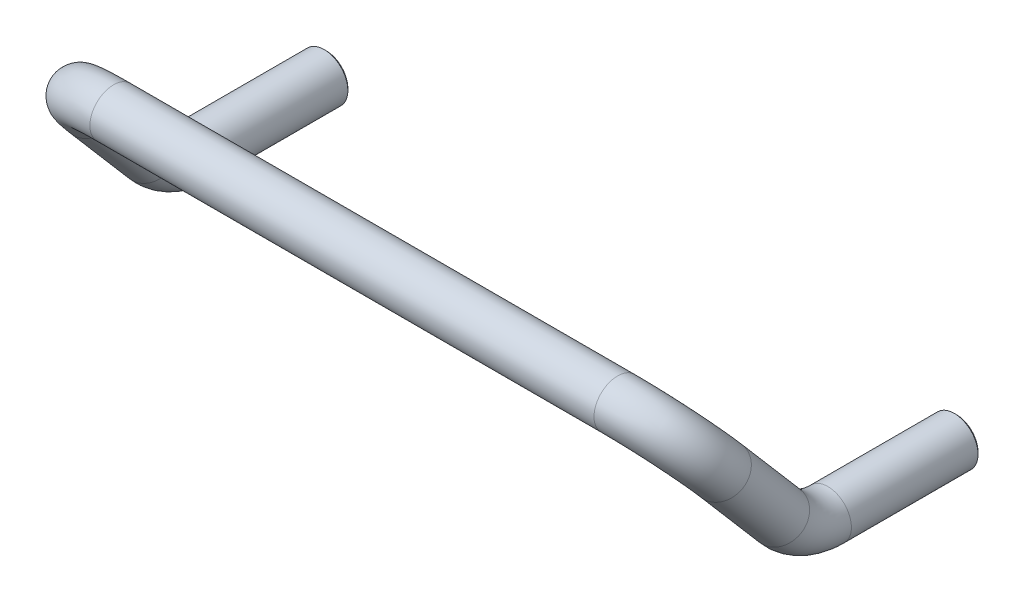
ISO-10303-21;
HEADER;
FILE_DESCRIPTION(('STEP AP214'),'2;1');
FILE_NAME('part.step','',(''),(''),'','','');
FILE_SCHEMA(('AUTOMOTIVE_DESIGN { 1 0 10303 214 1 1 1 1 }'));
ENDSEC;
DATA;
#1=APPLICATION_CONTEXT('core data for automotive mechanical design processes');
#2=APPLICATION_PROTOCOL_DEFINITION('international standard','automotive_design',2000,#1);
#3=PRODUCT_CONTEXT('',#1,'mechanical');
#4=PRODUCT('Part','Part','',(#3));
#5=PRODUCT_RELATED_PRODUCT_CATEGORY('part','',(#4));
#6=PRODUCT_DEFINITION_FORMATION('','',#4);
#7=PRODUCT_DEFINITION_CONTEXT('part definition',#1,'design');
#8=PRODUCT_DEFINITION('design','',#6,#7);
#9=PRODUCT_DEFINITION_SHAPE('','',#8);
#10=(LENGTH_UNIT() NAMED_UNIT(*) SI_UNIT(.MILLI.,.METRE.));
#11=(NAMED_UNIT(*) PLANE_ANGLE_UNIT() SI_UNIT($,.RADIAN.));
#12=(NAMED_UNIT(*) SI_UNIT($,.STERADIAN.) SOLID_ANGLE_UNIT());
#13=UNCERTAINTY_MEASURE_WITH_UNIT(LENGTH_MEASURE(1.E-05),#10,'distance_accuracy_value','');
#14=(GEOMETRIC_REPRESENTATION_CONTEXT(3) GLOBAL_UNCERTAINTY_ASSIGNED_CONTEXT((#13)) GLOBAL_UNIT_ASSIGNED_CONTEXT((#10,
#11,#12)) REPRESENTATION_CONTEXT('',''));
#15=CARTESIAN_POINT('',(0.,0.,0.));
#16=DIRECTION('',(0.,0.,1.));
#17=DIRECTION('',(1.,0.,0.));
#18=AXIS2_PLACEMENT_3D('',#15,#16,#17);
#19=CARTESIAN_POINT('',(0.,0.,0.));
#20=DIRECTION('',(0.,0.,-1.));
#21=DIRECTION('',(0.,1.,0.));
#22=AXIS2_PLACEMENT_3D('',#19,#20,#21);
#23=CONICAL_SURFACE('',#22,3.24999999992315,0.785398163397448);
#24=CARTESIAN_POINT('',(0.,0.,0.249999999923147));
#25=DIRECTION('',(0.,0.,-1.));
#26=DIRECTION('',(0.,1.,0.));
#27=AXIS2_PLACEMENT_3D('',#24,#25,#26);
#28=CIRCLE('',#27,3.);
#29=CARTESIAN_POINT('',(0.,3.,0.249999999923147));
#30=VERTEX_POINT('',#29);
#31=EDGE_CURVE('E15',#30,#30,#28,.F.);
#32=ORIENTED_EDGE('',*,*,#31,.T.);
#33=EDGE_LOOP('',(#32));
#34=FACE_BOUND('',#33,.T.);
#35=CARTESIAN_POINT('',(0.,0.,0.));
#36=DIRECTION('',(0.,0.,-1.));
#37=DIRECTION('',(0.,1.,0.));
#38=AXIS2_PLACEMENT_3D('',#35,#36,#37);
#39=CIRCLE('',#38,3.24999999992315);
#40=CARTESIAN_POINT('',(0.,3.24999999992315,0.));
#41=VERTEX_POINT('',#40);
#42=EDGE_CURVE('E131',#41,#41,#39,.T.);
#43=ORIENTED_EDGE('',*,*,#42,.T.);
#44=EDGE_LOOP('',(#43));
#45=FACE_BOUND('',#44,.T.);
#46=ADVANCED_FACE('F12',(#34,#45),#23,.F.);
#47=CARTESIAN_POINT('',(0.,0.,0.));
#48=DIRECTION('',(0.,0.,1.));
#49=DIRECTION('',(0.,-1.,0.));
#50=AXIS2_PLACEMENT_3D('',#47,#48,#49);
#51=PLANE('',#50);
#52=ORIENTED_EDGE('',*,*,#42,.F.);
#53=EDGE_LOOP('',(#52));
#54=FACE_BOUND('',#53,.T.);
#55=CARTESIAN_POINT('',(0.,0.,0.));
#56=DIRECTION('',(0.,0.,1.));
#57=DIRECTION('',(0.,-1.,0.));
#58=AXIS2_PLACEMENT_3D('',#55,#56,#57);
#59=CIRCLE('',#58,5.49999999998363);
#60=CARTESIAN_POINT('',(0.,-5.49999999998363,0.));
#61=VERTEX_POINT('',#60);
#62=EDGE_CURVE('E134',#61,#61,#59,.T.);
#63=ORIENTED_EDGE('',*,*,#62,.F.);
#64=EDGE_LOOP('',(#63));
#65=FACE_BOUND('',#64,.T.);
#66=ADVANCED_FACE('F47',(#54,#65),#51,.F.);
#67=CARTESIAN_POINT('',(0.,0.,0.499999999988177));
#68=DIRECTION('',(0.,0.,1.));
#69=DIRECTION('',(0.,-1.,0.));
#70=AXIS2_PLACEMENT_3D('',#67,#68,#69);
#71=CONICAL_SURFACE('',#70,5.99999999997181,0.785398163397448);
#72=ORIENTED_EDGE('',*,*,#62,.T.);
#73=EDGE_LOOP('',(#72));
#74=FACE_BOUND('',#73,.T.);
#75=CARTESIAN_POINT('',(0.,0.,0.499999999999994));
#76=DIRECTION('',(0.,0.,1.));
#77=DIRECTION('',(0.,-1.,0.));
#78=AXIS2_PLACEMENT_3D('',#75,#76,#77);
#79=CIRCLE('',#78,6.);
#80=CARTESIAN_POINT('',(0.,-6.,0.499999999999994));
#81=VERTEX_POINT('',#80);
#82=EDGE_CURVE('E137',#81,#81,#79,.T.);
#83=ORIENTED_EDGE('',*,*,#82,.F.);
#84=EDGE_LOOP('',(#83));
#85=FACE_BOUND('',#84,.T.);
#86=ADVANCED_FACE('F44',(#74,#85),#71,.T.);
#87=CARTESIAN_POINT('',(0.,0.,32.6410412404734));
#88=DIRECTION('',(0.,0.,1.));
#89=DIRECTION('',(0.,-1.,0.));
#90=AXIS2_PLACEMENT_3D('',#87,#88,#89);
#91=CYLINDRICAL_SURFACE('',#90,6.);
#92=CARTESIAN_POINT('',(0.,0.,32.6410412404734));
#93=DIRECTION('',(0.,0.,1.));
#94=DIRECTION('',(0.,-1.,0.));
#95=AXIS2_PLACEMENT_3D('',#92,#93,#94);
#96=CIRCLE('',#95,6.);
#97=CARTESIAN_POINT('',(0.,-6.,32.6410412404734));
#98=VERTEX_POINT('',#97);
#99=EDGE_CURVE('E24',#98,#98,#96,.T.);
#100=ORIENTED_EDGE('',*,*,#99,.F.);
#101=EDGE_LOOP('',(#100));
#102=FACE_BOUND('',#101,.T.);
#103=ORIENTED_EDGE('',*,*,#82,.T.);
#104=EDGE_LOOP('',(#103));
#105=FACE_BOUND('',#104,.T.);
#106=ADVANCED_FACE('F39',(#102,#105),#91,.T.);
#107=CARTESIAN_POINT('',(0.,16.,32.6410412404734));
#108=DIRECTION('',(-1.,0.,0.));
#109=DIRECTION('',(0.,-1.,0.));
#110=AXIS2_PLACEMENT_3D('',#107,#108,#109);
#111=TOROIDAL_SURFACE('',#110,16.,6.);
#112=ORIENTED_EDGE('',*,*,#99,.T.);
#113=EDGE_LOOP('',(#112));
#114=FACE_BOUND('',#113,.T.);
#115=CARTESIAN_POINT('',(0.,5.58733802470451,44.7891468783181));
#116=DIRECTION('',(0.,-0.759256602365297,-0.650791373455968));
#117=DIRECTION('',(0.,0.650791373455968,-0.759256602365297));
#118=AXIS2_PLACEMENT_3D('',#115,#116,#117);
#119=CIRCLE('',#118,6.);
#120=CARTESIAN_POINT('',(0.,9.49208626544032,40.2336072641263));
#121=VERTEX_POINT('',#120);
#122=EDGE_CURVE('E19',#121,#121,#119,.F.);
#123=ORIENTED_EDGE('',*,*,#122,.F.);
#124=EDGE_LOOP('',(#123));
#125=FACE_BOUND('',#124,.T.);
#126=ADVANCED_FACE('F34',(#114,#125),#111,.T.);
#127=CARTESIAN_POINT('',(0.,5.58733802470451,44.7891468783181));
#128=DIRECTION('',(0.,-0.759256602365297,-0.650791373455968));
#129=DIRECTION('',(0.,0.650791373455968,-0.759256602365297));
#130=AXIS2_PLACEMENT_3D('',#127,#128,#129);
#131=CYLINDRICAL_SURFACE('',#130,6.);
#132=ORIENTED_EDGE('',*,*,#122,.T.);
#133=EDGE_LOOP('',(#132));
#134=FACE_BOUND('',#133,.T.);
#135=CARTESIAN_POINT('',(0.,22.8518943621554,59.5873380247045));
#136=DIRECTION('',(0.,0.759256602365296,0.650791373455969));
#137=DIRECTION('',(-1.,0.,0.));
#138=AXIS2_PLACEMENT_3D('',#135,#136,#137);
#139=CIRCLE('',#138,6.);
#140=CARTESIAN_POINT('',(-6.,22.8518943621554,59.5873380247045));
#141=VERTEX_POINT('',#140);
#142=EDGE_CURVE('E8',#141,#141,#139,.T.);
#143=ORIENTED_EDGE('',*,*,#142,.F.);
#144=EDGE_LOOP('',(#143));
#145=FACE_BOUND('',#144,.T.);
#146=ADVANCED_FACE('F38',(#134,#145),#131,.T.);
#147=CARTESIAN_POINT('',(16.,22.8518943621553,59.5873380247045));
#148=DIRECTION('',(0.,0.650791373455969,-0.759256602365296));
#149=DIRECTION('',(0.,0.759256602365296,0.650791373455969));
#150=AXIS2_PLACEMENT_3D('',#147,#148,#149);
#151=TOROIDAL_SURFACE('',#150,16.,6.);
#152=ORIENTED_EDGE('',*,*,#142,.T.);
#153=EDGE_LOOP('',(#152));
#154=FACE_BOUND('',#153,.T.);
#155=CARTESIAN_POINT('',(16.,35.,70.));
#156=DIRECTION('',(1.,0.,0.));
#157=DIRECTION('',(0.,0.,-1.));
#158=AXIS2_PLACEMENT_3D('',#155,#156,#157);
#159=CIRCLE('',#158,6.);
#160=CARTESIAN_POINT('',(16.,35.,64.));
#161=VERTEX_POINT('',#160);
#162=EDGE_CURVE('E124',#161,#161,#159,.F.);
#163=ORIENTED_EDGE('',*,*,#162,.T.);
#164=EDGE_LOOP('',(#163));
#165=FACE_BOUND('',#164,.T.);
#166=ADVANCED_FACE('F59',(#154,#165),#151,.T.);
#167=CARTESIAN_POINT('',(0.,0.,12.));
#168=DIRECTION('',(0.,0.,-1.));
#169=DIRECTION('',(0.,1.,0.));
#170=AXIS2_PLACEMENT_3D('',#167,#168,#169);
#171=PLANE('',#170);
#172=CARTESIAN_POINT('',(0.,0.,12.));
#173=DIRECTION('',(0.,0.,-1.));
#174=DIRECTION('',(0.,1.,0.));
#175=AXIS2_PLACEMENT_3D('',#172,#173,#174);
#176=CIRCLE('',#175,3.);
#177=CARTESIAN_POINT('',(0.,3.,12.));
#178=VERTEX_POINT('',#177);
#179=EDGE_CURVE('E126',#178,#178,#176,.T.);
#180=ORIENTED_EDGE('',*,*,#179,.T.);
#181=EDGE_LOOP('',(#180));
#182=FACE_BOUND('',#181,.T.);
#183=ADVANCED_FACE('F56',(#182),#171,.T.);
#184=CARTESIAN_POINT('',(0.,0.,12.));
#185=DIRECTION('',(0.,0.,-1.));
#186=DIRECTION('',(0.,1.,0.));
#187=AXIS2_PLACEMENT_3D('',#184,#185,#186);
#188=CYLINDRICAL_SURFACE('',#187,3.);
#189=ORIENTED_EDGE('',*,*,#179,.F.);
#190=EDGE_LOOP('',(#189));
#191=FACE_BOUND('',#190,.T.);
#192=ORIENTED_EDGE('',*,*,#31,.F.);
#193=EDGE_LOOP('',(#192));
#194=FACE_BOUND('',#193,.T.);
#195=ADVANCED_FACE('F65',(#191,#194),#188,.F.);
#196=CARTESIAN_POINT('',(80.,35.,70.));
#197=DIRECTION('',(-1.,0.,0.));
#198=DIRECTION('',(0.,0.,1.));
#199=AXIS2_PLACEMENT_3D('',#196,#197,#198);
#200=CYLINDRICAL_SURFACE('',#199,6.);
#201=ORIENTED_EDGE('',*,*,#162,.F.);
#202=EDGE_LOOP('',(#201));
#203=FACE_BOUND('',#202,.T.);
#204=CARTESIAN_POINT('',(144.,35.,70.));
#205=DIRECTION('',(1.,0.,0.));
#206=DIRECTION('',(0.,0.,-1.));
#207=AXIS2_PLACEMENT_3D('',#204,#205,#206);
#208=CIRCLE('',#207,6.);
#209=CARTESIAN_POINT('',(144.,35.,64.));
#210=VERTEX_POINT('',#209);
#211=EDGE_CURVE('E176',#210,#210,#208,.F.);
#212=ORIENTED_EDGE('',*,*,#211,.T.);
#213=EDGE_LOOP('',(#212));
#214=FACE_BOUND('',#213,.T.);
#215=ADVANCED_FACE('F72',(#203,#214),#200,.T.);
#216=CARTESIAN_POINT('',(160.,0.,0.));
#217=DIRECTION('',(0.,0.,-1.));
#218=DIRECTION('',(0.,1.,0.));
#219=AXIS2_PLACEMENT_3D('',#216,#217,#218);
#220=CONICAL_SURFACE('',#219,3.24999999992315,0.785398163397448);
#221=CARTESIAN_POINT('',(160.,0.,0.249999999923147));
#222=DIRECTION('',(0.,0.,1.));
#223=DIRECTION('',(0.,1.,0.));
#224=AXIS2_PLACEMENT_3D('',#221,#222,#223);
#225=CIRCLE('',#224,3.);
#226=CARTESIAN_POINT('',(160.,3.,0.249999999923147));
#227=VERTEX_POINT('',#226);
#228=EDGE_CURVE('E120',#227,#227,#225,.F.);
#229=ORIENTED_EDGE('',*,*,#228,.F.);
#230=EDGE_LOOP('',(#229));
#231=FACE_BOUND('',#230,.T.);
#232=CARTESIAN_POINT('',(160.,0.,0.));
#233=DIRECTION('',(0.,0.,1.));
#234=DIRECTION('',(0.,1.,0.));
#235=AXIS2_PLACEMENT_3D('',#232,#233,#234);
#236=CIRCLE('',#235,3.24999999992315);
#237=CARTESIAN_POINT('',(160.,3.24999999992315,0.));
#238=VERTEX_POINT('',#237);
#239=EDGE_CURVE('E117',#238,#238,#236,.T.);
#240=ORIENTED_EDGE('',*,*,#239,.F.);
#241=EDGE_LOOP('',(#240));
#242=FACE_BOUND('',#241,.T.);
#243=ADVANCED_FACE('F77',(#231,#242),#220,.F.);
#244=CARTESIAN_POINT('',(160.,0.,0.));
#245=DIRECTION('',(0.,0.,1.));
#246=DIRECTION('',(0.,-1.,0.));
#247=AXIS2_PLACEMENT_3D('',#244,#245,#246);
#248=PLANE('',#247);
#249=ORIENTED_EDGE('',*,*,#239,.T.);
#250=EDGE_LOOP('',(#249));
#251=FACE_BOUND('',#250,.T.);
#252=CARTESIAN_POINT('',(160.,0.,0.));
#253=DIRECTION('',(0.,0.,-1.));
#254=DIRECTION('',(0.,-1.,0.));
#255=AXIS2_PLACEMENT_3D('',#252,#253,#254);
#256=CIRCLE('',#255,5.49999999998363);
#257=CARTESIAN_POINT('',(160.,-5.49999999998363,0.));
#258=VERTEX_POINT('',#257);
#259=EDGE_CURVE('E112',#258,#258,#256,.T.);
#260=ORIENTED_EDGE('',*,*,#259,.T.);
#261=EDGE_LOOP('',(#260));
#262=FACE_BOUND('',#261,.T.);
#263=ADVANCED_FACE('F81',(#251,#262),#248,.F.);
#264=CARTESIAN_POINT('',(160.,0.,0.499999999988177));
#265=DIRECTION('',(0.,0.,1.));
#266=DIRECTION('',(0.,-1.,0.));
#267=AXIS2_PLACEMENT_3D('',#264,#265,#266);
#268=CONICAL_SURFACE('',#267,5.99999999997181,0.785398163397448);
#269=ORIENTED_EDGE('',*,*,#259,.F.);
#270=EDGE_LOOP('',(#269));
#271=FACE_BOUND('',#270,.T.);
#272=CARTESIAN_POINT('',(160.,0.,0.499999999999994));
#273=DIRECTION('',(0.,0.,-1.));
#274=DIRECTION('',(0.,-1.,0.));
#275=AXIS2_PLACEMENT_3D('',#272,#273,#274);
#276=CIRCLE('',#275,6.);
#277=CARTESIAN_POINT('',(160.,-6.,0.499999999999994));
#278=VERTEX_POINT('',#277);
#279=EDGE_CURVE('E109',#278,#278,#276,.T.);
#280=ORIENTED_EDGE('',*,*,#279,.T.);
#281=EDGE_LOOP('',(#280));
#282=FACE_BOUND('',#281,.T.);
#283=ADVANCED_FACE('F85',(#271,#282),#268,.T.);
#284=CARTESIAN_POINT('',(160.,0.,32.6410412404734));
#285=DIRECTION('',(0.,0.,1.));
#286=DIRECTION('',(0.,-1.,0.));
#287=AXIS2_PLACEMENT_3D('',#284,#285,#286);
#288=CYLINDRICAL_SURFACE('',#287,6.);
#289=CARTESIAN_POINT('',(160.,0.,32.6410412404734));
#290=DIRECTION('',(0.,0.,-1.));
#291=DIRECTION('',(0.,-1.,0.));
#292=AXIS2_PLACEMENT_3D('',#289,#290,#291);
#293=CIRCLE('',#292,6.);
#294=CARTESIAN_POINT('',(160.,-6.,32.6410412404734));
#295=VERTEX_POINT('',#294);
#296=EDGE_CURVE('E106',#295,#295,#293,.T.);
#297=ORIENTED_EDGE('',*,*,#296,.T.);
#298=EDGE_LOOP('',(#297));
#299=FACE_BOUND('',#298,.T.);
#300=ORIENTED_EDGE('',*,*,#279,.F.);
#301=EDGE_LOOP('',(#300));
#302=FACE_BOUND('',#301,.T.);
#303=ADVANCED_FACE('F89',(#299,#302),#288,.T.);
#304=CARTESIAN_POINT('',(160.,16.,32.6410412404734));
#305=DIRECTION('',(1.,0.,0.));
#306=DIRECTION('',(0.,-1.,0.));
#307=AXIS2_PLACEMENT_3D('',#304,#305,#306);
#308=TOROIDAL_SURFACE('',#307,16.,6.);
#309=ORIENTED_EDGE('',*,*,#296,.F.);
#310=EDGE_LOOP('',(#309));
#311=FACE_BOUND('',#310,.T.);
#312=CARTESIAN_POINT('',(160.,5.58733802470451,44.7891468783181));
#313=DIRECTION('',(0.,0.759256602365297,0.650791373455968));
#314=DIRECTION('',(0.,0.650791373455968,-0.759256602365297));
#315=AXIS2_PLACEMENT_3D('',#312,#313,#314);
#316=CIRCLE('',#315,6.);
#317=CARTESIAN_POINT('',(160.,9.49208626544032,40.2336072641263));
#318=VERTEX_POINT('',#317);
#319=EDGE_CURVE('E104',#318,#318,#316,.F.);
#320=ORIENTED_EDGE('',*,*,#319,.T.);
#321=EDGE_LOOP('',(#320));
#322=FACE_BOUND('',#321,.T.);
#323=ADVANCED_FACE('F93',(#311,#322),#308,.T.);
#324=CARTESIAN_POINT('',(160.,5.58733802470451,44.7891468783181));
#325=DIRECTION('',(0.,-0.759256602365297,-0.650791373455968));
#326=DIRECTION('',(0.,0.650791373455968,-0.759256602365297));
#327=AXIS2_PLACEMENT_3D('',#324,#325,#326);
#328=CYLINDRICAL_SURFACE('',#327,6.);
#329=ORIENTED_EDGE('',*,*,#319,.F.);
#330=EDGE_LOOP('',(#329));
#331=FACE_BOUND('',#330,.T.);
#332=CARTESIAN_POINT('',(160.,22.8518943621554,59.5873380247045));
#333=DIRECTION('',(0.,-0.759256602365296,-0.650791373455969));
#334=DIRECTION('',(1.,0.,0.));
#335=AXIS2_PLACEMENT_3D('',#332,#333,#334);
#336=CIRCLE('',#335,6.);
#337=CARTESIAN_POINT('',(166.,22.8518943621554,59.5873380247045));
#338=VERTEX_POINT('',#337);
#339=EDGE_CURVE('E127',#338,#338,#336,.T.);
#340=ORIENTED_EDGE('',*,*,#339,.T.);
#341=EDGE_LOOP('',(#340));
#342=FACE_BOUND('',#341,.T.);
#343=ADVANCED_FACE('F98',(#331,#342),#328,.T.);
#344=CARTESIAN_POINT('',(144.,22.8518943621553,59.5873380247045));
#345=DIRECTION('',(0.,0.650791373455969,-0.759256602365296));
#346=DIRECTION('',(0.,0.759256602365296,0.650791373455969));
#347=AXIS2_PLACEMENT_3D('',#344,#345,#346);
#348=TOROIDAL_SURFACE('',#347,16.,6.);
#349=ORIENTED_EDGE('',*,*,#339,.F.);
#350=EDGE_LOOP('',(#349));
#351=FACE_BOUND('',#350,.T.);
#352=ORIENTED_EDGE('',*,*,#211,.F.);
#353=EDGE_LOOP('',(#352));
#354=FACE_BOUND('',#353,.T.);
#355=ADVANCED_FACE('F161',(#351,#354),#348,.T.);
#356=CARTESIAN_POINT('',(160.,0.,12.));
#357=DIRECTION('',(0.,0.,-1.));
#358=DIRECTION('',(0.,1.,0.));
#359=AXIS2_PLACEMENT_3D('',#356,#357,#358);
#360=PLANE('',#359);
#361=CARTESIAN_POINT('',(160.,0.,12.));
#362=DIRECTION('',(0.,0.,1.));
#363=DIRECTION('',(0.,1.,0.));
#364=AXIS2_PLACEMENT_3D('',#361,#362,#363);
#365=CIRCLE('',#364,3.);
#366=CARTESIAN_POINT('',(160.,3.,12.));
#367=VERTEX_POINT('',#366);
#368=EDGE_CURVE('E123',#367,#367,#365,.T.);
#369=ORIENTED_EDGE('',*,*,#368,.F.);
#370=EDGE_LOOP('',(#369));
#371=FACE_BOUND('',#370,.T.);
#372=ADVANCED_FACE('F164',(#371),#360,.T.);
#373=CARTESIAN_POINT('',(160.,0.,12.));
#374=DIRECTION('',(0.,0.,-1.));
#375=DIRECTION('',(0.,1.,0.));
#376=AXIS2_PLACEMENT_3D('',#373,#374,#375);
#377=CYLINDRICAL_SURFACE('',#376,3.);
#378=ORIENTED_EDGE('',*,*,#368,.T.);
#379=EDGE_LOOP('',(#378));
#380=FACE_BOUND('',#379,.T.);
#381=ORIENTED_EDGE('',*,*,#228,.T.);
#382=EDGE_LOOP('',(#381));
#383=FACE_BOUND('',#382,.T.);
#384=ADVANCED_FACE('F166',(#380,#383),#377,.F.);
#385=CLOSED_SHELL('',(#46,#66,#86,#106,#126,#146,#166,#183,#195,#215,#243,#263,#283,#303,#323,
#343,#355,#372,#384));
#386=MANIFOLD_SOLID_BREP('B1',#385);
#387=ADVANCED_BREP_SHAPE_REPRESENTATION('',(#18,#386),#14);
#388=SHAPE_DEFINITION_REPRESENTATION(#9,#387);
ENDSEC;
END-ISO-10303-21;
